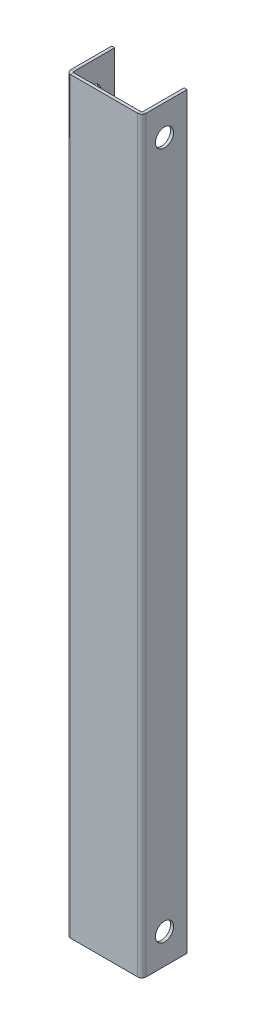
ISO-10303-21;
HEADER;
FILE_DESCRIPTION(('STEP AP214'),'2;1');
FILE_NAME('part.step','',(''),(''),'','','');
FILE_SCHEMA(('AUTOMOTIVE_DESIGN { 1 0 10303 214 1 1 1 1 }'));
ENDSEC;
DATA;
#1=APPLICATION_CONTEXT('core data for automotive mechanical design processes');
#2=APPLICATION_PROTOCOL_DEFINITION('international standard','automotive_design',2000,#1);
#3=PRODUCT_CONTEXT('',#1,'mechanical');
#4=PRODUCT('Part','Part','',(#3));
#5=PRODUCT_RELATED_PRODUCT_CATEGORY('part','',(#4));
#6=PRODUCT_DEFINITION_FORMATION('','',#4);
#7=PRODUCT_DEFINITION_CONTEXT('part definition',#1,'design');
#8=PRODUCT_DEFINITION('design','',#6,#7);
#9=PRODUCT_DEFINITION_SHAPE('','',#8);
#10=(LENGTH_UNIT() NAMED_UNIT(*) SI_UNIT(.MILLI.,.METRE.));
#11=(NAMED_UNIT(*) PLANE_ANGLE_UNIT() SI_UNIT($,.RADIAN.));
#12=(NAMED_UNIT(*) SI_UNIT($,.STERADIAN.) SOLID_ANGLE_UNIT());
#13=UNCERTAINTY_MEASURE_WITH_UNIT(LENGTH_MEASURE(1.E-05),#10,'distance_accuracy_value','');
#14=(GEOMETRIC_REPRESENTATION_CONTEXT(3) GLOBAL_UNCERTAINTY_ASSIGNED_CONTEXT((#13)) GLOBAL_UNIT_ASSIGNED_CONTEXT((#10,
#11,#12)) REPRESENTATION_CONTEXT('',''));
#15=CARTESIAN_POINT('',(0.,0.,0.));
#16=DIRECTION('',(0.,0.,1.));
#17=DIRECTION('',(1.,0.,0.));
#18=AXIS2_PLACEMENT_3D('',#15,#16,#17);
#19=CARTESIAN_POINT('',(-25.,496.,12.2634));
#20=DIRECTION('',(0.,1.,0.));
#21=DIRECTION('',(0.,0.,1.));
#22=AXIS2_PLACEMENT_3D('',#19,#20,#21);
#23=PLANE('',#22);
#24=DIRECTION('',(1.,0.,0.));
#25=VECTOR('',#24,1.);
#26=CARTESIAN_POINT('',(-25.,496.,12.2634));
#27=LINE('',#26,#25);
#28=CARTESIAN_POINT('',(-25.,496.,12.2634));
#29=VERTEX_POINT('',#28);
#30=CARTESIAN_POINT('',(-23.,496.,12.2634));
#31=VERTEX_POINT('',#30);
#32=EDGE_CURVE('E11',#29,#31,#27,.T.);
#33=ORIENTED_EDGE('',*,*,#32,.F.);
#34=CARTESIAN_POINT('',(-22.2634,496.,12.2634));
#35=DIRECTION('',(0.,-1.,0.));
#36=DIRECTION('',(0.,0.,-1.));
#37=AXIS2_PLACEMENT_3D('',#34,#35,#36);
#38=CIRCLE('',#37,2.7366);
#39=CARTESIAN_POINT('',(-22.2634,496.,15.));
#40=VERTEX_POINT('',#39);
#41=EDGE_CURVE('E312',#40,#29,#38,.T.);
#42=ORIENTED_EDGE('',*,*,#41,.F.);
#43=DIRECTION('',(0.,0.,1.));
#44=VECTOR('',#43,1.);
#45=CARTESIAN_POINT('',(-22.2634,496.,13.));
#46=LINE('',#45,#44);
#47=CARTESIAN_POINT('',(-22.2634,496.,13.));
#48=VERTEX_POINT('',#47);
#49=EDGE_CURVE('E50',#48,#40,#46,.T.);
#50=ORIENTED_EDGE('',*,*,#49,.F.);
#51=CARTESIAN_POINT('',(-22.2634,496.,12.2634));
#52=DIRECTION('',(0.,1.,0.));
#53=DIRECTION('',(1.,0.,0.));
#54=AXIS2_PLACEMENT_3D('',#51,#52,#53);
#55=CIRCLE('',#54,0.7366);
#56=EDGE_CURVE('E179',#48,#31,#55,.F.);
#57=ORIENTED_EDGE('',*,*,#56,.T.);
#58=EDGE_LOOP('',(#33,#42,#50,#57));
#59=FACE_BOUND('',#58,.T.);
#60=ADVANCED_FACE('F40',(#59),#23,.T.);
#61=CARTESIAN_POINT('',(-22.2634,496.,13.));
#62=DIRECTION('',(0.,1.,0.));
#63=DIRECTION('',(0.,0.,1.));
#64=AXIS2_PLACEMENT_3D('',#61,#62,#63);
#65=PLANE('',#64);
#66=DIRECTION('',(0.,0.,-1.));
#67=VECTOR('',#66,1.);
#68=CARTESIAN_POINT('',(-25.,496.,-15.));
#69=LINE('',#68,#67);
#70=CARTESIAN_POINT('',(-25.,496.,-15.));
#71=VERTEX_POINT('',#70);
#72=EDGE_CURVE('E308',#29,#71,#69,.T.);
#73=ORIENTED_EDGE('',*,*,#72,.F.);
#74=ORIENTED_EDGE('',*,*,#32,.T.);
#75=DIRECTION('',(0.,0.,-1.));
#76=VECTOR('',#75,1.);
#77=CARTESIAN_POINT('',(-23.,496.,-15.));
#78=LINE('',#77,#76);
#79=CARTESIAN_POINT('',(-23.,496.,-15.));
#80=VERTEX_POINT('',#79);
#81=EDGE_CURVE('E111',#31,#80,#78,.T.);
#82=ORIENTED_EDGE('',*,*,#81,.T.);
#83=DIRECTION('',(1.,0.,0.));
#84=VECTOR('',#83,1.);
#85=CARTESIAN_POINT('',(-25.,496.,-15.));
#86=LINE('',#85,#84);
#87=EDGE_CURVE('E304',#71,#80,#86,.T.);
#88=ORIENTED_EDGE('',*,*,#87,.F.);
#89=EDGE_LOOP('',(#73,#74,#82,#88));
#90=FACE_BOUND('',#89,.T.);
#91=ADVANCED_FACE('F367',(#90),#65,.T.);
#92=CARTESIAN_POINT('',(-22.2634,0.,15.));
#93=DIRECTION('',(0.,-1.,0.));
#94=DIRECTION('',(0.,0.,-1.));
#95=AXIS2_PLACEMENT_3D('',#92,#93,#94);
#96=PLANE('',#95);
#97=DIRECTION('',(0.,0.,-1.));
#98=VECTOR('',#97,1.);
#99=CARTESIAN_POINT('',(-22.2634,0.,15.));
#100=LINE('',#99,#98);
#101=CARTESIAN_POINT('',(-22.2634,0.,15.));
#102=VERTEX_POINT('',#101);
#103=CARTESIAN_POINT('',(-22.2634,0.,13.));
#104=VERTEX_POINT('',#103);
#105=EDGE_CURVE('E98',#102,#104,#100,.T.);
#106=ORIENTED_EDGE('',*,*,#105,.F.);
#107=CARTESIAN_POINT('',(-22.2634,0.,12.2634));
#108=DIRECTION('',(0.,-1.,0.));
#109=DIRECTION('',(0.,0.,-1.));
#110=AXIS2_PLACEMENT_3D('',#107,#108,#109);
#111=CIRCLE('',#110,2.7366);
#112=CARTESIAN_POINT('',(-25.,0.,12.2634));
#113=VERTEX_POINT('',#112);
#114=EDGE_CURVE('E199',#102,#113,#111,.T.);
#115=ORIENTED_EDGE('',*,*,#114,.T.);
#116=DIRECTION('',(-1.,0.,0.));
#117=VECTOR('',#116,1.);
#118=CARTESIAN_POINT('',(-23.,0.,12.2634));
#119=LINE('',#118,#117);
#120=CARTESIAN_POINT('',(-23.,0.,12.2634));
#121=VERTEX_POINT('',#120);
#122=EDGE_CURVE('E105',#121,#113,#119,.T.);
#123=ORIENTED_EDGE('',*,*,#122,.F.);
#124=CARTESIAN_POINT('',(-22.2634,0.,12.2634));
#125=DIRECTION('',(0.,1.,0.));
#126=DIRECTION('',(1.,0.,0.));
#127=AXIS2_PLACEMENT_3D('',#124,#125,#126);
#128=CIRCLE('',#127,0.7366);
#129=EDGE_CURVE('E226',#104,#121,#128,.F.);
#130=ORIENTED_EDGE('',*,*,#129,.F.);
#131=EDGE_LOOP('',(#106,#115,#123,#130));
#132=FACE_BOUND('',#131,.T.);
#133=ADVANCED_FACE('F355',(#132),#96,.T.);
#134=CARTESIAN_POINT('',(-23.,0.,12.2634));
#135=DIRECTION('',(0.,-1.,0.));
#136=DIRECTION('',(0.,0.,-1.));
#137=AXIS2_PLACEMENT_3D('',#134,#135,#136);
#138=PLANE('',#137);
#139=DIRECTION('',(-1.,0.,0.));
#140=VECTOR('',#139,1.);
#141=CARTESIAN_POINT('',(-25.,0.,15.));
#142=LINE('',#141,#140);
#143=CARTESIAN_POINT('',(22.2634,0.,15.));
#144=VERTEX_POINT('',#143);
#145=EDGE_CURVE('E202',#144,#102,#142,.T.);
#146=ORIENTED_EDGE('',*,*,#145,.T.);
#147=ORIENTED_EDGE('',*,*,#105,.T.);
#148=DIRECTION('',(1.,0.,0.));
#149=VECTOR('',#148,1.);
#150=CARTESIAN_POINT('',(-25.,0.,13.));
#151=LINE('',#150,#149);
#152=CARTESIAN_POINT('',(22.2634,0.,13.));
#153=VERTEX_POINT('',#152);
#154=EDGE_CURVE('E223',#153,#104,#151,.F.);
#155=ORIENTED_EDGE('',*,*,#154,.F.);
#156=DIRECTION('',(0.,0.,1.));
#157=VECTOR('',#156,1.);
#158=CARTESIAN_POINT('',(22.2634,0.,13.));
#159=LINE('',#158,#157);
#160=EDGE_CURVE('E264',#153,#144,#159,.T.);
#161=ORIENTED_EDGE('',*,*,#160,.T.);
#162=EDGE_LOOP('',(#146,#147,#155,#161));
#163=FACE_BOUND('',#162,.T.);
#164=ADVANCED_FACE('F342',(#163),#138,.T.);
#165=CARTESIAN_POINT('',(22.2634,496.,15.));
#166=DIRECTION('',(0.,1.,0.));
#167=DIRECTION('',(0.,0.,1.));
#168=AXIS2_PLACEMENT_3D('',#165,#166,#167);
#169=PLANE('',#168);
#170=DIRECTION('',(0.,0.,-1.));
#171=VECTOR('',#170,1.);
#172=CARTESIAN_POINT('',(22.2634,496.,15.));
#173=LINE('',#172,#171);
#174=CARTESIAN_POINT('',(22.2634,496.,15.));
#175=VERTEX_POINT('',#174);
#176=CARTESIAN_POINT('',(22.2634,496.,13.));
#177=VERTEX_POINT('',#176);
#178=EDGE_CURVE('E139',#175,#177,#173,.T.);
#179=ORIENTED_EDGE('',*,*,#178,.F.);
#180=CARTESIAN_POINT('',(22.2634,496.,12.2634));
#181=DIRECTION('',(0.,-1.,0.));
#182=DIRECTION('',(0.,0.,-1.));
#183=AXIS2_PLACEMENT_3D('',#180,#181,#182);
#184=CIRCLE('',#183,2.7366);
#185=CARTESIAN_POINT('',(25.,496.,12.2634));
#186=VERTEX_POINT('',#185);
#187=EDGE_CURVE('E318',#186,#175,#184,.T.);
#188=ORIENTED_EDGE('',*,*,#187,.F.);
#189=DIRECTION('',(1.,0.,0.));
#190=VECTOR('',#189,1.);
#191=CARTESIAN_POINT('',(23.,496.,12.2634));
#192=LINE('',#191,#190);
#193=CARTESIAN_POINT('',(23.,496.,12.2634));
#194=VERTEX_POINT('',#193);
#195=EDGE_CURVE('E152',#194,#186,#192,.T.);
#196=ORIENTED_EDGE('',*,*,#195,.F.);
#197=CARTESIAN_POINT('',(22.2634,496.,12.2634));
#198=DIRECTION('',(0.,1.,0.));
#199=DIRECTION('',(1.,0.,0.));
#200=AXIS2_PLACEMENT_3D('',#197,#198,#199);
#201=CIRCLE('',#200,0.7366);
#202=EDGE_CURVE('E155',#194,#177,#201,.F.);
#203=ORIENTED_EDGE('',*,*,#202,.T.);
#204=EDGE_LOOP('',(#179,#188,#196,#203));
#205=FACE_BOUND('',#204,.T.);
#206=ADVANCED_FACE('F157',(#205),#169,.T.);
#207=CARTESIAN_POINT('',(23.,496.,12.2634));
#208=DIRECTION('',(0.,1.,0.));
#209=DIRECTION('',(0.,0.,1.));
#210=AXIS2_PLACEMENT_3D('',#207,#208,#209);
#211=PLANE('',#210);
#212=DIRECTION('',(-1.,0.,0.));
#213=VECTOR('',#212,1.);
#214=CARTESIAN_POINT('',(-25.,496.,15.));
#215=LINE('',#214,#213);
#216=EDGE_CURVE('E146',#175,#40,#215,.T.);
#217=ORIENTED_EDGE('',*,*,#216,.F.);
#218=ORIENTED_EDGE('',*,*,#178,.T.);
#219=DIRECTION('',(1.,0.,0.));
#220=VECTOR('',#219,1.);
#221=CARTESIAN_POINT('',(-25.,496.,13.));
#222=LINE('',#221,#220);
#223=EDGE_CURVE('E143',#177,#48,#222,.F.);
#224=ORIENTED_EDGE('',*,*,#223,.T.);
#225=ORIENTED_EDGE('',*,*,#49,.T.);
#226=EDGE_LOOP('',(#217,#218,#224,#225));
#227=FACE_BOUND('',#226,.T.);
#228=ADVANCED_FACE('F141',(#227),#211,.T.);
#229=CARTESIAN_POINT('',(25.,0.,12.2634));
#230=DIRECTION('',(0.,-1.,0.));
#231=DIRECTION('',(0.,0.,-1.));
#232=AXIS2_PLACEMENT_3D('',#229,#230,#231);
#233=PLANE('',#232);
#234=DIRECTION('',(-1.,0.,0.));
#235=VECTOR('',#234,1.);
#236=CARTESIAN_POINT('',(25.,0.,12.2634));
#237=LINE('',#236,#235);
#238=CARTESIAN_POINT('',(25.,0.,12.2634));
#239=VERTEX_POINT('',#238);
#240=CARTESIAN_POINT('',(23.,0.,12.2634));
#241=VERTEX_POINT('',#240);
#242=EDGE_CURVE('E267',#239,#241,#237,.T.);
#243=ORIENTED_EDGE('',*,*,#242,.F.);
#244=CARTESIAN_POINT('',(22.2634,0.,12.2634));
#245=DIRECTION('',(0.,-1.,0.));
#246=DIRECTION('',(0.,0.,-1.));
#247=AXIS2_PLACEMENT_3D('',#244,#245,#246);
#248=CIRCLE('',#247,2.7366);
#249=EDGE_CURVE('E205',#239,#144,#248,.T.);
#250=ORIENTED_EDGE('',*,*,#249,.T.);
#251=ORIENTED_EDGE('',*,*,#160,.F.);
#252=CARTESIAN_POINT('',(22.2634,0.,12.2634));
#253=DIRECTION('',(0.,1.,0.));
#254=DIRECTION('',(1.,0.,0.));
#255=AXIS2_PLACEMENT_3D('',#252,#253,#254);
#256=CIRCLE('',#255,0.7366);
#257=EDGE_CURVE('E169',#241,#153,#256,.F.);
#258=ORIENTED_EDGE('',*,*,#257,.F.);
#259=EDGE_LOOP('',(#243,#250,#251,#258));
#260=FACE_BOUND('',#259,.T.);
#261=ADVANCED_FACE('F340',(#260),#233,.T.);
#262=CARTESIAN_POINT('',(22.2634,0.,13.));
#263=DIRECTION('',(0.,-1.,0.));
#264=DIRECTION('',(0.,0.,-1.));
#265=AXIS2_PLACEMENT_3D('',#262,#263,#264);
#266=PLANE('',#265);
#267=DIRECTION('',(0.,0.,1.));
#268=VECTOR('',#267,1.);
#269=CARTESIAN_POINT('',(25.,0.,-15.));
#270=LINE('',#269,#268);
#271=CARTESIAN_POINT('',(25.,0.,-15.));
#272=VERTEX_POINT('',#271);
#273=EDGE_CURVE('E209',#272,#239,#270,.T.);
#274=ORIENTED_EDGE('',*,*,#273,.T.);
#275=ORIENTED_EDGE('',*,*,#242,.T.);
#276=DIRECTION('',(0.,0.,1.));
#277=VECTOR('',#276,1.);
#278=CARTESIAN_POINT('',(23.,0.,-15.));
#279=LINE('',#278,#277);
#280=CARTESIAN_POINT('',(23.,0.,-15.));
#281=VERTEX_POINT('',#280);
#282=EDGE_CURVE('E217',#281,#241,#279,.T.);
#283=ORIENTED_EDGE('',*,*,#282,.F.);
#284=DIRECTION('',(1.,0.,0.));
#285=VECTOR('',#284,1.);
#286=CARTESIAN_POINT('',(23.,0.,-15.));
#287=LINE('',#286,#285);
#288=EDGE_CURVE('E213',#281,#272,#287,.T.);
#289=ORIENTED_EDGE('',*,*,#288,.T.);
#290=EDGE_LOOP('',(#274,#275,#283,#289));
#291=FACE_BOUND('',#290,.T.);
#292=ADVANCED_FACE('F399',(#291),#266,.T.);
#293=CARTESIAN_POINT('',(-23.,496.,-15.));
#294=DIRECTION('',(-1.,0.,0.));
#295=DIRECTION('',(0.,0.,1.));
#296=AXIS2_PLACEMENT_3D('',#293,#294,#295);
#297=PLANE('',#296);
#298=CARTESIAN_POINT('',(-23.,20.,0.));
#299=DIRECTION('',(-1.,0.,0.));
#300=DIRECTION('',(0.,0.,1.));
#301=AXIS2_PLACEMENT_3D('',#298,#299,#300);
#302=CIRCLE('',#301,6.);
#303=CARTESIAN_POINT('',(-23.,20.,6.));
#304=VERTEX_POINT('',#303);
#305=EDGE_CURVE('E289',#304,#304,#302,.T.);
#306=ORIENTED_EDGE('',*,*,#305,.T.);
#307=EDGE_LOOP('',(#306));
#308=FACE_BOUND('',#307,.T.);
#309=CARTESIAN_POINT('',(-23.,476.,0.));
#310=DIRECTION('',(-1.,0.,0.));
#311=DIRECTION('',(0.,0.,1.));
#312=AXIS2_PLACEMENT_3D('',#309,#310,#311);
#313=CIRCLE('',#312,6.00000000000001);
#314=CARTESIAN_POINT('',(-23.,476.,6.00000000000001));
#315=VERTEX_POINT('',#314);
#316=EDGE_CURVE('E191',#315,#315,#313,.T.);
#317=ORIENTED_EDGE('',*,*,#316,.T.);
#318=EDGE_LOOP('',(#317));
#319=FACE_BOUND('',#318,.T.);
#320=DIRECTION('',(0.,0.,-1.));
#321=VECTOR('',#320,1.);
#322=CARTESIAN_POINT('',(-23.,0.,-15.));
#323=LINE('',#322,#321);
#324=CARTESIAN_POINT('',(-23.,0.,-15.));
#325=VERTEX_POINT('',#324);
#326=EDGE_CURVE('E186',#121,#325,#323,.T.);
#327=ORIENTED_EDGE('',*,*,#326,.T.);
#328=DIRECTION('',(0.,-1.,0.));
#329=VECTOR('',#328,1.);
#330=CARTESIAN_POINT('',(-23.,496.,-15.));
#331=LINE('',#330,#329);
#332=EDGE_CURVE('E261',#80,#325,#331,.T.);
#333=ORIENTED_EDGE('',*,*,#332,.F.);
#334=ORIENTED_EDGE('',*,*,#81,.F.);
#335=DIRECTION('',(0.,-1.,0.));
#336=VECTOR('',#335,1.);
#337=CARTESIAN_POINT('',(-23.,496.,12.2634));
#338=LINE('',#337,#336);
#339=EDGE_CURVE('E182',#31,#121,#338,.T.);
#340=ORIENTED_EDGE('',*,*,#339,.T.);
#341=EDGE_LOOP('',(#327,#333,#334,#340));
#342=FACE_BOUND('',#341,.T.);
#343=ADVANCED_FACE('F361',(#308,#319,#342),#297,.F.);
#344=CARTESIAN_POINT('',(-25.,496.,-15.));
#345=DIRECTION('',(0.,0.,-1.));
#346=DIRECTION('',(-1.,0.,0.));
#347=AXIS2_PLACEMENT_3D('',#344,#345,#346);
#348=PLANE('',#347);
#349=DIRECTION('',(1.,0.,0.));
#350=VECTOR('',#349,1.);
#351=CARTESIAN_POINT('',(-25.,0.,-15.));
#352=LINE('',#351,#350);
#353=CARTESIAN_POINT('',(-25.,0.,-15.));
#354=VERTEX_POINT('',#353);
#355=EDGE_CURVE('E190',#354,#325,#352,.T.);
#356=ORIENTED_EDGE('',*,*,#355,.F.);
#357=DIRECTION('',(0.,-1.,0.));
#358=VECTOR('',#357,1.);
#359=CARTESIAN_POINT('',(-25.,496.,-15.));
#360=LINE('',#359,#358);
#361=EDGE_CURVE('E258',#71,#354,#360,.T.);
#362=ORIENTED_EDGE('',*,*,#361,.F.);
#363=ORIENTED_EDGE('',*,*,#87,.T.);
#364=ORIENTED_EDGE('',*,*,#332,.T.);
#365=EDGE_LOOP('',(#356,#362,#363,#364));
#366=FACE_BOUND('',#365,.T.);
#367=ADVANCED_FACE('F366',(#366),#348,.T.);
#368=CARTESIAN_POINT('',(-25.,496.,-15.));
#369=DIRECTION('',(-1.,0.,0.));
#370=DIRECTION('',(0.,0.,1.));
#371=AXIS2_PLACEMENT_3D('',#368,#369,#370);
#372=PLANE('',#371);
#373=CARTESIAN_POINT('',(-25.,20.,0.));
#374=DIRECTION('',(-1.,0.,0.));
#375=DIRECTION('',(0.,0.,1.));
#376=AXIS2_PLACEMENT_3D('',#373,#374,#375);
#377=CIRCLE('',#376,6.);
#378=CARTESIAN_POINT('',(-25.,20.,6.));
#379=VERTEX_POINT('',#378);
#380=EDGE_CURVE('E295',#379,#379,#377,.T.);
#381=ORIENTED_EDGE('',*,*,#380,.F.);
#382=EDGE_LOOP('',(#381));
#383=FACE_BOUND('',#382,.T.);
#384=CARTESIAN_POINT('',(-25.,476.,0.));
#385=DIRECTION('',(-1.,0.,0.));
#386=DIRECTION('',(0.,0.,1.));
#387=AXIS2_PLACEMENT_3D('',#384,#385,#386);
#388=CIRCLE('',#387,6.00000000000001);
#389=CARTESIAN_POINT('',(-25.,476.,6.00000000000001));
#390=VERTEX_POINT('',#389);
#391=EDGE_CURVE('E281',#390,#390,#388,.T.);
#392=ORIENTED_EDGE('',*,*,#391,.F.);
#393=EDGE_LOOP('',(#392));
#394=FACE_BOUND('',#393,.T.);
#395=DIRECTION('',(0.,0.,-1.));
#396=VECTOR('',#395,1.);
#397=CARTESIAN_POINT('',(-25.,0.,-15.));
#398=LINE('',#397,#396);
#399=EDGE_CURVE('E195',#113,#354,#398,.T.);
#400=ORIENTED_EDGE('',*,*,#399,.F.);
#401=DIRECTION('',(0.,-1.,0.));
#402=VECTOR('',#401,1.);
#403=CARTESIAN_POINT('',(-25.,496.,12.2634));
#404=LINE('',#403,#402);
#405=EDGE_CURVE('E254',#29,#113,#404,.T.);
#406=ORIENTED_EDGE('',*,*,#405,.F.);
#407=ORIENTED_EDGE('',*,*,#72,.T.);
#408=ORIENTED_EDGE('',*,*,#361,.T.);
#409=EDGE_LOOP('',(#400,#406,#407,#408));
#410=FACE_BOUND('',#409,.T.);
#411=ADVANCED_FACE('F369',(#383,#394,#410),#372,.T.);
#412=CARTESIAN_POINT('',(-22.2634,496.,12.2634));
#413=DIRECTION('',(0.,-1.,0.));
#414=DIRECTION('',(0.,0.,-1.));
#415=AXIS2_PLACEMENT_3D('',#412,#413,#414);
#416=CYLINDRICAL_SURFACE('',#415,2.7366);
#417=ORIENTED_EDGE('',*,*,#114,.F.);
#418=DIRECTION('',(0.,-1.,0.));
#419=VECTOR('',#418,1.);
#420=CARTESIAN_POINT('',(-22.2634,496.,15.));
#421=LINE('',#420,#419);
#422=EDGE_CURVE('E250',#40,#102,#421,.T.);
#423=ORIENTED_EDGE('',*,*,#422,.F.);
#424=ORIENTED_EDGE('',*,*,#41,.T.);
#425=ORIENTED_EDGE('',*,*,#405,.T.);
#426=EDGE_LOOP('',(#417,#423,#424,#425));
#427=FACE_BOUND('',#426,.T.);
#428=ADVANCED_FACE('F352',(#427),#416,.T.);
#429=CARTESIAN_POINT('',(-25.,496.,15.));
#430=DIRECTION('',(0.,0.,1.));
#431=DIRECTION('',(1.,0.,0.));
#432=AXIS2_PLACEMENT_3D('',#429,#430,#431);
#433=PLANE('',#432);
#434=ORIENTED_EDGE('',*,*,#145,.F.);
#435=DIRECTION('',(0.,-1.,0.));
#436=VECTOR('',#435,1.);
#437=CARTESIAN_POINT('',(22.2634,496.,15.));
#438=LINE('',#437,#436);
#439=EDGE_CURVE('E246',#175,#144,#438,.T.);
#440=ORIENTED_EDGE('',*,*,#439,.F.);
#441=ORIENTED_EDGE('',*,*,#216,.T.);
#442=ORIENTED_EDGE('',*,*,#422,.T.);
#443=EDGE_LOOP('',(#434,#440,#441,#442));
#444=FACE_BOUND('',#443,.T.);
#445=ADVANCED_FACE('F347',(#444),#433,.T.);
#446=CARTESIAN_POINT('',(22.2634,496.,12.2634));
#447=DIRECTION('',(0.,-1.,0.));
#448=DIRECTION('',(0.,0.,-1.));
#449=AXIS2_PLACEMENT_3D('',#446,#447,#448);
#450=CYLINDRICAL_SURFACE('',#449,2.7366);
#451=ORIENTED_EDGE('',*,*,#249,.F.);
#452=DIRECTION('',(0.,-1.,0.));
#453=VECTOR('',#452,1.);
#454=CARTESIAN_POINT('',(25.,496.,12.2634));
#455=LINE('',#454,#453);
#456=EDGE_CURVE('E242',#186,#239,#455,.T.);
#457=ORIENTED_EDGE('',*,*,#456,.F.);
#458=ORIENTED_EDGE('',*,*,#187,.T.);
#459=ORIENTED_EDGE('',*,*,#439,.T.);
#460=EDGE_LOOP('',(#451,#457,#458,#459));
#461=FACE_BOUND('',#460,.T.);
#462=ADVANCED_FACE('F345',(#461),#450,.T.);
#463=CARTESIAN_POINT('',(25.,496.,-15.));
#464=DIRECTION('',(1.,0.,0.));
#465=DIRECTION('',(0.,0.,-1.));
#466=AXIS2_PLACEMENT_3D('',#463,#464,#465);
#467=PLANE('',#466);
#468=CARTESIAN_POINT('',(25.,20.,0.));
#469=DIRECTION('',(1.,0.,0.));
#470=DIRECTION('',(0.,0.,-1.));
#471=AXIS2_PLACEMENT_3D('',#468,#469,#470);
#472=CIRCLE('',#471,6.);
#473=CARTESIAN_POINT('',(25.,20.,-6.));
#474=VERTEX_POINT('',#473);
#475=EDGE_CURVE('E606',#474,#474,#472,.T.);
#476=ORIENTED_EDGE('',*,*,#475,.F.);
#477=EDGE_LOOP('',(#476));
#478=FACE_BOUND('',#477,.T.);
#479=CARTESIAN_POINT('',(25.,476.,0.));
#480=DIRECTION('',(1.,0.,0.));
#481=DIRECTION('',(0.,0.,-1.));
#482=AXIS2_PLACEMENT_3D('',#479,#480,#481);
#483=CIRCLE('',#482,6.00000000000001);
#484=CARTESIAN_POINT('',(25.,476.,-6.00000000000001));
#485=VERTEX_POINT('',#484);
#486=EDGE_CURVE('E280',#485,#485,#483,.T.);
#487=ORIENTED_EDGE('',*,*,#486,.F.);
#488=EDGE_LOOP('',(#487));
#489=FACE_BOUND('',#488,.T.);
#490=ORIENTED_EDGE('',*,*,#273,.F.);
#491=DIRECTION('',(0.,-1.,0.));
#492=VECTOR('',#491,1.);
#493=CARTESIAN_POINT('',(25.,496.,-15.));
#494=LINE('',#493,#492);
#495=CARTESIAN_POINT('',(25.,496.,-15.));
#496=VERTEX_POINT('',#495);
#497=EDGE_CURVE('E239',#496,#272,#494,.T.);
#498=ORIENTED_EDGE('',*,*,#497,.F.);
#499=DIRECTION('',(0.,0.,1.));
#500=VECTOR('',#499,1.);
#501=CARTESIAN_POINT('',(25.,496.,-15.));
#502=LINE('',#501,#500);
#503=EDGE_CURVE('E321',#496,#186,#502,.T.);
#504=ORIENTED_EDGE('',*,*,#503,.T.);
#505=ORIENTED_EDGE('',*,*,#456,.T.);
#506=EDGE_LOOP('',(#490,#498,#504,#505));
#507=FACE_BOUND('',#506,.T.);
#508=ADVANCED_FACE('F441',(#478,#489,#507),#467,.T.);
#509=CARTESIAN_POINT('',(23.,496.,-15.));
#510=DIRECTION('',(0.,0.,-1.));
#511=DIRECTION('',(-1.,0.,0.));
#512=AXIS2_PLACEMENT_3D('',#509,#510,#511);
#513=PLANE('',#512);
#514=ORIENTED_EDGE('',*,*,#288,.F.);
#515=DIRECTION('',(0.,-1.,0.));
#516=VECTOR('',#515,1.);
#517=CARTESIAN_POINT('',(23.,496.,-15.));
#518=LINE('',#517,#516);
#519=CARTESIAN_POINT('',(23.,496.,-15.));
#520=VERTEX_POINT('',#519);
#521=EDGE_CURVE('E236',#520,#281,#518,.T.);
#522=ORIENTED_EDGE('',*,*,#521,.F.);
#523=DIRECTION('',(1.,0.,0.));
#524=VECTOR('',#523,1.);
#525=CARTESIAN_POINT('',(23.,496.,-15.));
#526=LINE('',#525,#524);
#527=EDGE_CURVE('E325',#520,#496,#526,.T.);
#528=ORIENTED_EDGE('',*,*,#527,.T.);
#529=ORIENTED_EDGE('',*,*,#497,.T.);
#530=EDGE_LOOP('',(#514,#522,#528,#529));
#531=FACE_BOUND('',#530,.T.);
#532=ADVANCED_FACE('F437',(#531),#513,.T.);
#533=CARTESIAN_POINT('',(23.,496.,-15.));
#534=DIRECTION('',(1.,0.,0.));
#535=DIRECTION('',(0.,0.,-1.));
#536=AXIS2_PLACEMENT_3D('',#533,#534,#535);
#537=PLANE('',#536);
#538=CARTESIAN_POINT('',(23.,20.,0.));
#539=DIRECTION('',(1.,0.,0.));
#540=DIRECTION('',(0.,0.,-1.));
#541=AXIS2_PLACEMENT_3D('',#538,#539,#540);
#542=CIRCLE('',#541,6.);
#543=CARTESIAN_POINT('',(23.,20.,-6.));
#544=VERTEX_POINT('',#543);
#545=EDGE_CURVE('E43',#544,#544,#542,.T.);
#546=ORIENTED_EDGE('',*,*,#545,.T.);
#547=EDGE_LOOP('',(#546));
#548=FACE_BOUND('',#547,.T.);
#549=CARTESIAN_POINT('',(23.,476.,0.));
#550=DIRECTION('',(1.,0.,0.));
#551=DIRECTION('',(0.,0.,-1.));
#552=AXIS2_PLACEMENT_3D('',#549,#550,#551);
#553=CIRCLE('',#552,6.00000000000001);
#554=CARTESIAN_POINT('',(23.,476.,-6.00000000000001));
#555=VERTEX_POINT('',#554);
#556=EDGE_CURVE('E277',#555,#555,#553,.T.);
#557=ORIENTED_EDGE('',*,*,#556,.T.);
#558=EDGE_LOOP('',(#557));
#559=FACE_BOUND('',#558,.T.);
#560=ORIENTED_EDGE('',*,*,#282,.T.);
#561=DIRECTION('',(0.,-1.,0.));
#562=VECTOR('',#561,1.);
#563=CARTESIAN_POINT('',(23.,496.,12.2634));
#564=LINE('',#563,#562);
#565=EDGE_CURVE('E172',#194,#241,#564,.T.);
#566=ORIENTED_EDGE('',*,*,#565,.F.);
#567=DIRECTION('',(0.,0.,1.));
#568=VECTOR('',#567,1.);
#569=CARTESIAN_POINT('',(23.,496.,-15.));
#570=LINE('',#569,#568);
#571=EDGE_CURVE('E162',#520,#194,#570,.T.);
#572=ORIENTED_EDGE('',*,*,#571,.F.);
#573=ORIENTED_EDGE('',*,*,#521,.T.);
#574=EDGE_LOOP('',(#560,#566,#572,#573));
#575=FACE_BOUND('',#574,.T.);
#576=ADVANCED_FACE('F337',(#548,#559,#575),#537,.F.);
#577=CARTESIAN_POINT('',(22.2634,496.,12.2634));
#578=DIRECTION('',(0.,-1.,0.));
#579=DIRECTION('',(0.,0.,-1.));
#580=AXIS2_PLACEMENT_3D('',#577,#578,#579);
#581=CYLINDRICAL_SURFACE('',#580,0.7366);
#582=ORIENTED_EDGE('',*,*,#257,.T.);
#583=DIRECTION('',(0.,-1.,0.));
#584=VECTOR('',#583,1.);
#585=CARTESIAN_POINT('',(22.2634,496.,13.));
#586=LINE('',#585,#584);
#587=EDGE_CURVE('E166',#177,#153,#586,.T.);
#588=ORIENTED_EDGE('',*,*,#587,.F.);
#589=ORIENTED_EDGE('',*,*,#202,.F.);
#590=ORIENTED_EDGE('',*,*,#565,.T.);
#591=EDGE_LOOP('',(#582,#588,#589,#590));
#592=FACE_BOUND('',#591,.T.);
#593=ADVANCED_FACE('F167',(#592),#581,.F.);
#594=CARTESIAN_POINT('',(-25.,496.,13.));
#595=DIRECTION('',(0.,0.,1.));
#596=DIRECTION('',(1.,0.,0.));
#597=AXIS2_PLACEMENT_3D('',#594,#595,#596);
#598=PLANE('',#597);
#599=ORIENTED_EDGE('',*,*,#154,.T.);
#600=DIRECTION('',(0.,-1.,0.));
#601=VECTOR('',#600,1.);
#602=CARTESIAN_POINT('',(-22.2634,496.,13.));
#603=LINE('',#602,#601);
#604=EDGE_CURVE('E173',#48,#104,#603,.T.);
#605=ORIENTED_EDGE('',*,*,#604,.F.);
#606=ORIENTED_EDGE('',*,*,#223,.F.);
#607=ORIENTED_EDGE('',*,*,#587,.T.);
#608=EDGE_LOOP('',(#599,#605,#606,#607));
#609=FACE_BOUND('',#608,.T.);
#610=ADVANCED_FACE('F175',(#609),#598,.F.);
#611=CARTESIAN_POINT('',(-22.2634,496.,12.2634));
#612=DIRECTION('',(0.,-1.,0.));
#613=DIRECTION('',(0.,0.,-1.));
#614=AXIS2_PLACEMENT_3D('',#611,#612,#613);
#615=CYLINDRICAL_SURFACE('',#614,0.7366);
#616=ORIENTED_EDGE('',*,*,#129,.T.);
#617=ORIENTED_EDGE('',*,*,#339,.F.);
#618=ORIENTED_EDGE('',*,*,#56,.F.);
#619=ORIENTED_EDGE('',*,*,#604,.T.);
#620=EDGE_LOOP('',(#616,#617,#618,#619));
#621=FACE_BOUND('',#620,.T.);
#622=ADVANCED_FACE('F358',(#621),#615,.F.);
#623=CARTESIAN_POINT('',(-22.2634,496.,12.2634));
#624=DIRECTION('',(0.,-1.,0.));
#625=DIRECTION('',(-1.,0.,0.));
#626=AXIS2_PLACEMENT_3D('',#623,#624,#625);
#627=PLANE('',#626);
#628=ORIENTED_EDGE('',*,*,#571,.T.);
#629=ORIENTED_EDGE('',*,*,#195,.T.);
#630=ORIENTED_EDGE('',*,*,#503,.F.);
#631=ORIENTED_EDGE('',*,*,#527,.F.);
#632=EDGE_LOOP('',(#628,#629,#630,#631));
#633=FACE_BOUND('',#632,.T.);
#634=ADVANCED_FACE('F333',(#633),#627,.F.);
#635=CARTESIAN_POINT('',(-22.2634,0.,12.2634));
#636=DIRECTION('',(0.,-1.,0.));
#637=DIRECTION('',(-1.,0.,0.));
#638=AXIS2_PLACEMENT_3D('',#635,#636,#637);
#639=PLANE('',#638);
#640=ORIENTED_EDGE('',*,*,#326,.F.);
#641=ORIENTED_EDGE('',*,*,#122,.T.);
#642=ORIENTED_EDGE('',*,*,#399,.T.);
#643=ORIENTED_EDGE('',*,*,#355,.T.);
#644=EDGE_LOOP('',(#640,#641,#642,#643));
#645=FACE_BOUND('',#644,.T.);
#646=ADVANCED_FACE('F363',(#645),#639,.T.);
#647=CARTESIAN_POINT('',(47.,476.,0.));
#648=DIRECTION('',(-1.,0.,0.));
#649=DIRECTION('',(0.,0.,1.));
#650=AXIS2_PLACEMENT_3D('',#647,#648,#649);
#651=CYLINDRICAL_SURFACE('',#650,6.00000000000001);
#652=ORIENTED_EDGE('',*,*,#486,.T.);
#653=EDGE_LOOP('',(#652));
#654=FACE_BOUND('',#653,.T.);
#655=ORIENTED_EDGE('',*,*,#556,.F.);
#656=EDGE_LOOP('',(#655));
#657=FACE_BOUND('',#656,.T.);
#658=ADVANCED_FACE('F414',(#654,#657),#651,.F.);
#659=ORIENTED_EDGE('',*,*,#391,.T.);
#660=EDGE_LOOP('',(#659));
#661=FACE_BOUND('',#660,.T.);
#662=ORIENTED_EDGE('',*,*,#316,.F.);
#663=EDGE_LOOP('',(#662));
#664=FACE_BOUND('',#663,.T.);
#665=ADVANCED_FACE('F411',(#661,#664),#651,.F.);
#666=CARTESIAN_POINT('',(-47.,20.,0.));
#667=DIRECTION('',(1.,0.,0.));
#668=DIRECTION('',(0.,0.,-1.));
#669=AXIS2_PLACEMENT_3D('',#666,#667,#668);
#670=CYLINDRICAL_SURFACE('',#669,6.);
#671=ORIENTED_EDGE('',*,*,#475,.T.);
#672=EDGE_LOOP('',(#671));
#673=FACE_BOUND('',#672,.T.);
#674=ORIENTED_EDGE('',*,*,#545,.F.);
#675=EDGE_LOOP('',(#674));
#676=FACE_BOUND('',#675,.T.);
#677=ADVANCED_FACE('F413',(#673,#676),#670,.F.);
#678=ORIENTED_EDGE('',*,*,#380,.T.);
#679=EDGE_LOOP('',(#678));
#680=FACE_BOUND('',#679,.T.);
#681=ORIENTED_EDGE('',*,*,#305,.F.);
#682=EDGE_LOOP('',(#681));
#683=FACE_BOUND('',#682,.T.);
#684=ADVANCED_FACE('F420',(#680,#683),#670,.F.);
#685=CLOSED_SHELL('',(#60,#91,#133,#164,#206,#228,#261,#292,#343,#367,#411,#428,#445,#462,#508,
#532,#576,#593,#610,#622,#634,#646,#658,#665,#677,#684));
#686=MANIFOLD_SOLID_BREP('B2',#685);
#687=ADVANCED_BREP_SHAPE_REPRESENTATION('',(#18,#686),#14);
#688=SHAPE_DEFINITION_REPRESENTATION(#9,#687);
ENDSEC;
END-ISO-10303-21;
